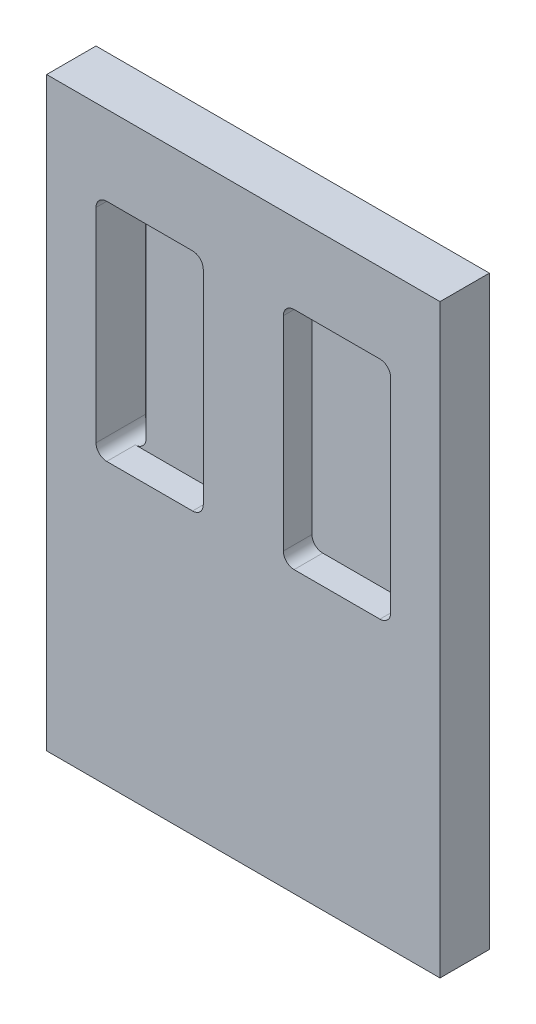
ISO-10303-21;
HEADER;
FILE_DESCRIPTION(('STEP AP214'),'2;1');
FILE_NAME('part.step','',(''),(''),'','','');
FILE_SCHEMA(('AUTOMOTIVE_DESIGN { 1 0 10303 214 1 1 1 1 }'));
ENDSEC;
DATA;
#1=APPLICATION_CONTEXT('core data for automotive mechanical design processes');
#2=APPLICATION_PROTOCOL_DEFINITION('international standard','automotive_design',2000,#1);
#3=PRODUCT_CONTEXT('',#1,'mechanical');
#4=PRODUCT('Part','Part','',(#3));
#5=PRODUCT_RELATED_PRODUCT_CATEGORY('part','',(#4));
#6=PRODUCT_DEFINITION_FORMATION('','',#4);
#7=PRODUCT_DEFINITION_CONTEXT('part definition',#1,'design');
#8=PRODUCT_DEFINITION('design','',#6,#7);
#9=PRODUCT_DEFINITION_SHAPE('','',#8);
#10=(LENGTH_UNIT() NAMED_UNIT(*) SI_UNIT(.MILLI.,.METRE.));
#11=(NAMED_UNIT(*) PLANE_ANGLE_UNIT() SI_UNIT($,.RADIAN.));
#12=(NAMED_UNIT(*) SI_UNIT($,.STERADIAN.) SOLID_ANGLE_UNIT());
#13=UNCERTAINTY_MEASURE_WITH_UNIT(LENGTH_MEASURE(1.E-05),#10,'distance_accuracy_value','');
#14=(GEOMETRIC_REPRESENTATION_CONTEXT(3) GLOBAL_UNCERTAINTY_ASSIGNED_CONTEXT((#13)) GLOBAL_UNIT_ASSIGNED_CONTEXT((#10,
#11,#12)) REPRESENTATION_CONTEXT('',''));
#15=CARTESIAN_POINT('',(0.,0.,0.));
#16=DIRECTION('',(0.,0.,1.));
#17=DIRECTION('',(1.,0.,0.));
#18=AXIS2_PLACEMENT_3D('',#15,#16,#17);
#19=CARTESIAN_POINT('',(10.668,51.7525,8.763));
#20=DIRECTION('',(0.,0.,-1.));
#21=DIRECTION('',(-1.,0.,0.));
#22=AXIS2_PLACEMENT_3D('',#19,#20,#21);
#23=CYLINDRICAL_SURFACE('',#22,1.905);
#24=CARTESIAN_POINT('',(10.668,51.7525,0.));
#25=DIRECTION('',(0.,0.,1.));
#26=DIRECTION('',(1.,0.,0.));
#27=AXIS2_PLACEMENT_3D('',#24,#25,#26);
#28=CIRCLE('',#27,1.905);
#29=CARTESIAN_POINT('',(8.763,51.7525,0.));
#30=VERTEX_POINT('',#29);
#31=CARTESIAN_POINT('',(12.573,51.7525,0.));
#32=VERTEX_POINT('',#31);
#33=EDGE_CURVE('E335',#30,#32,#28,.T.);
#34=ORIENTED_EDGE('',*,*,#33,.F.);
#35=DIRECTION('',(0.,0.,-1.));
#36=VECTOR('',#35,1.);
#37=CARTESIAN_POINT('',(8.763,51.7525,8.763));
#38=LINE('',#37,#36);
#39=CARTESIAN_POINT('',(8.763,51.7525,8.763));
#40=VERTEX_POINT('',#39);
#41=EDGE_CURVE('E343',#40,#30,#38,.T.);
#42=ORIENTED_EDGE('',*,*,#41,.F.);
#43=CARTESIAN_POINT('',(10.668,51.7525,8.763));
#44=DIRECTION('',(0.,0.,1.));
#45=DIRECTION('',(1.,0.,0.));
#46=AXIS2_PLACEMENT_3D('',#43,#44,#45);
#47=CIRCLE('',#46,1.905);
#48=CARTESIAN_POINT('',(10.668,49.8475,8.763));
#49=VERTEX_POINT('',#48);
#50=EDGE_CURVE('E326',#40,#49,#47,.T.);
#51=ORIENTED_EDGE('',*,*,#50,.T.);
#52=DIRECTION('',(0.,0.,1.));
#53=VECTOR('',#52,1.);
#54=CARTESIAN_POINT('',(10.668,49.8475,3.683));
#55=LINE('',#54,#53);
#56=CARTESIAN_POINT('',(10.668,49.8475,3.683));
#57=VERTEX_POINT('',#56);
#58=EDGE_CURVE('E237',#57,#49,#55,.T.);
#59=ORIENTED_EDGE('',*,*,#58,.F.);
#60=CARTESIAN_POINT('',(10.668,51.7525,3.683));
#61=DIRECTION('',(0.,0.,1.));
#62=DIRECTION('',(1.,0.,0.));
#63=AXIS2_PLACEMENT_3D('',#60,#61,#62);
#64=CIRCLE('',#63,1.905);
#65=CARTESIAN_POINT('',(12.573,51.7525,3.683));
#66=VERTEX_POINT('',#65);
#67=EDGE_CURVE('E236',#57,#66,#64,.T.);
#68=ORIENTED_EDGE('',*,*,#67,.T.);
#69=DIRECTION('',(0.,0.,-1.));
#70=VECTOR('',#69,1.);
#71=CARTESIAN_POINT('',(12.573,51.7525,8.763));
#72=LINE('',#71,#70);
#73=EDGE_CURVE('E341',#66,#32,#72,.T.);
#74=ORIENTED_EDGE('',*,*,#73,.T.);
#75=EDGE_LOOP('',(#34,#42,#51,#59,#68,#74));
#76=FACE_BOUND('',#75,.T.);
#77=ADVANCED_FACE('F32',(#76),#23,.F.);
#78=CARTESIAN_POINT('',(12.573,87.9475,8.763));
#79=DIRECTION('',(-1.,0.,0.));
#80=DIRECTION('',(0.,-1.,0.));
#81=AXIS2_PLACEMENT_3D('',#78,#79,#80);
#82=PLANE('',#81);
#83=ORIENTED_EDGE('',*,*,#73,.F.);
#84=DIRECTION('',(0.,1.,0.));
#85=VECTOR('',#84,1.);
#86=CARTESIAN_POINT('',(12.573,87.9475,3.683));
#87=LINE('',#86,#85);
#88=CARTESIAN_POINT('',(12.573,87.9475,3.683));
#89=VERTEX_POINT('',#88);
#90=EDGE_CURVE('E11',#66,#89,#87,.T.);
#91=ORIENTED_EDGE('',*,*,#90,.T.);
#92=DIRECTION('',(0.,0.,-1.));
#93=VECTOR('',#92,1.);
#94=CARTESIAN_POINT('',(12.573,87.9475,8.763));
#95=LINE('',#94,#93);
#96=CARTESIAN_POINT('',(12.573,87.9475,0.));
#97=VERTEX_POINT('',#96);
#98=EDGE_CURVE('E329',#89,#97,#95,.T.);
#99=ORIENTED_EDGE('',*,*,#98,.T.);
#100=DIRECTION('',(0.,1.,0.));
#101=VECTOR('',#100,1.);
#102=CARTESIAN_POINT('',(12.573,87.9475,0.));
#103=LINE('',#102,#101);
#104=EDGE_CURVE('E324',#32,#97,#103,.T.);
#105=ORIENTED_EDGE('',*,*,#104,.F.);
#106=EDGE_LOOP('',(#83,#91,#99,#105));
#107=FACE_BOUND('',#106,.T.);
#108=ADVANCED_FACE('F398',(#107),#82,.T.);
#109=CARTESIAN_POINT('',(0.,104.013,8.763));
#110=DIRECTION('',(0.,0.,-1.));
#111=DIRECTION('',(-1.,0.,0.));
#112=AXIS2_PLACEMENT_3D('',#109,#110,#111);
#113=PLANE('',#112);
#114=CARTESIAN_POINT('',(25.908,51.7525,8.763));
#115=DIRECTION('',(0.,0.,1.));
#116=DIRECTION('',(1.,0.,0.));
#117=AXIS2_PLACEMENT_3D('',#114,#115,#116);
#118=CIRCLE('',#117,1.905);
#119=CARTESIAN_POINT('',(25.908,49.8475,8.763));
#120=VERTEX_POINT('',#119);
#121=CARTESIAN_POINT('',(27.813,51.7525,8.763));
#122=VERTEX_POINT('',#121);
#123=EDGE_CURVE('E201',#120,#122,#118,.T.);
#124=ORIENTED_EDGE('',*,*,#123,.F.);
#125=DIRECTION('',(1.,0.,0.));
#126=VECTOR('',#125,1.);
#127=CARTESIAN_POINT('',(10.668,49.8475,8.763));
#128=LINE('',#127,#126);
#129=EDGE_CURVE('E217',#49,#120,#128,.T.);
#130=ORIENTED_EDGE('',*,*,#129,.F.);
#131=ORIENTED_EDGE('',*,*,#50,.F.);
#132=DIRECTION('',(0.,-1.,0.));
#133=VECTOR('',#132,1.);
#134=CARTESIAN_POINT('',(8.76299999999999,87.9475,8.763));
#135=LINE('',#134,#133);
#136=CARTESIAN_POINT('',(8.76299999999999,87.9475,8.763));
#137=VERTEX_POINT('',#136);
#138=EDGE_CURVE('E323',#137,#40,#135,.T.);
#139=ORIENTED_EDGE('',*,*,#138,.F.);
#140=CARTESIAN_POINT('',(10.668,87.9475,8.763));
#141=DIRECTION('',(0.,0.,1.));
#142=DIRECTION('',(1.,0.,0.));
#143=AXIS2_PLACEMENT_3D('',#140,#141,#142);
#144=CIRCLE('',#143,1.905);
#145=CARTESIAN_POINT('',(10.668,89.8525,8.763));
#146=VERTEX_POINT('',#145);
#147=EDGE_CURVE('E321',#146,#137,#144,.T.);
#148=ORIENTED_EDGE('',*,*,#147,.F.);
#149=DIRECTION('',(-1.,0.,0.));
#150=VECTOR('',#149,1.);
#151=CARTESIAN_POINT('',(10.668,89.8525,8.763));
#152=LINE('',#151,#150);
#153=CARTESIAN_POINT('',(25.908,89.8525,8.763));
#154=VERTEX_POINT('',#153);
#155=EDGE_CURVE('E220',#154,#146,#152,.T.);
#156=ORIENTED_EDGE('',*,*,#155,.F.);
#157=CARTESIAN_POINT('',(25.908,87.9475,8.763));
#158=DIRECTION('',(0.,0.,1.));
#159=DIRECTION('',(1.,0.,0.));
#160=AXIS2_PLACEMENT_3D('',#157,#158,#159);
#161=CIRCLE('',#160,1.905);
#162=CARTESIAN_POINT('',(27.813,87.9475,8.763));
#163=VERTEX_POINT('',#162);
#164=EDGE_CURVE('E230',#163,#154,#161,.T.);
#165=ORIENTED_EDGE('',*,*,#164,.F.);
#166=DIRECTION('',(0.,1.,0.));
#167=VECTOR('',#166,1.);
#168=CARTESIAN_POINT('',(27.813,87.9475,8.763));
#169=LINE('',#168,#167);
#170=EDGE_CURVE('E228',#122,#163,#169,.T.);
#171=ORIENTED_EDGE('',*,*,#170,.F.);
#172=EDGE_LOOP('',(#124,#130,#131,#139,#148,#156,#165,#171));
#173=FACE_BOUND('',#172,.T.);
#174=DIRECTION('',(0.,-1.,0.));
#175=VECTOR('',#174,1.);
#176=CARTESIAN_POINT('',(0.,0.,8.763));
#177=LINE('',#176,#175);
#178=CARTESIAN_POINT('',(0.,104.013,8.763));
#179=VERTEX_POINT('',#178);
#180=CARTESIAN_POINT('',(0.,0.,8.763));
#181=VERTEX_POINT('',#180);
#182=EDGE_CURVE('E348',#179,#181,#177,.T.);
#183=ORIENTED_EDGE('',*,*,#182,.T.);
#184=DIRECTION('',(1.,0.,0.));
#185=VECTOR('',#184,1.);
#186=CARTESIAN_POINT('',(0.,0.,8.763));
#187=LINE('',#186,#185);
#188=CARTESIAN_POINT('',(69.85,0.,8.763));
#189=VERTEX_POINT('',#188);
#190=EDGE_CURVE('E351',#181,#189,#187,.T.);
#191=ORIENTED_EDGE('',*,*,#190,.T.);
#192=DIRECTION('',(0.,1.,0.));
#193=VECTOR('',#192,1.);
#194=CARTESIAN_POINT('',(69.85,0.,8.763));
#195=LINE('',#194,#193);
#196=CARTESIAN_POINT('',(69.85,104.013,8.763));
#197=VERTEX_POINT('',#196);
#198=EDGE_CURVE('E354',#189,#197,#195,.T.);
#199=ORIENTED_EDGE('',*,*,#198,.T.);
#200=DIRECTION('',(-1.,0.,0.));
#201=VECTOR('',#200,1.);
#202=CARTESIAN_POINT('',(0.,104.013,8.763));
#203=LINE('',#202,#201);
#204=EDGE_CURVE('E356',#197,#179,#203,.T.);
#205=ORIENTED_EDGE('',*,*,#204,.T.);
#206=EDGE_LOOP('',(#183,#191,#199,#205));
#207=FACE_BOUND('',#206,.T.);
#208=CARTESIAN_POINT('',(59.182,51.7525,8.763));
#209=DIRECTION('',(0.,0.,1.));
#210=DIRECTION('',(1.,0.,0.));
#211=AXIS2_PLACEMENT_3D('',#208,#209,#210);
#212=CIRCLE('',#211,1.90500000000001);
#213=CARTESIAN_POINT('',(59.182,49.8475,8.763));
#214=VERTEX_POINT('',#213);
#215=CARTESIAN_POINT('',(61.087,51.7525,8.763));
#216=VERTEX_POINT('',#215);
#217=EDGE_CURVE('E297',#214,#216,#212,.T.);
#218=ORIENTED_EDGE('',*,*,#217,.F.);
#219=DIRECTION('',(1.,0.,0.));
#220=VECTOR('',#219,1.);
#221=CARTESIAN_POINT('',(59.182,49.8475,8.763));
#222=LINE('',#221,#220);
#223=CARTESIAN_POINT('',(43.942,49.8475,8.763));
#224=VERTEX_POINT('',#223);
#225=EDGE_CURVE('E253',#224,#214,#222,.T.);
#226=ORIENTED_EDGE('',*,*,#225,.F.);
#227=CARTESIAN_POINT('',(43.942,51.7525,8.763));
#228=DIRECTION('',(0.,0.,1.));
#229=DIRECTION('',(-1.,0.,0.));
#230=AXIS2_PLACEMENT_3D('',#227,#228,#229);
#231=CIRCLE('',#230,1.905);
#232=CARTESIAN_POINT('',(42.037,51.7525,8.763));
#233=VERTEX_POINT('',#232);
#234=EDGE_CURVE('E271',#233,#224,#231,.T.);
#235=ORIENTED_EDGE('',*,*,#234,.F.);
#236=DIRECTION('',(0.,-1.,0.));
#237=VECTOR('',#236,1.);
#238=CARTESIAN_POINT('',(42.037,87.9475,8.763));
#239=LINE('',#238,#237);
#240=CARTESIAN_POINT('',(42.037,87.9475,8.763));
#241=VERTEX_POINT('',#240);
#242=EDGE_CURVE('E268',#241,#233,#239,.T.);
#243=ORIENTED_EDGE('',*,*,#242,.F.);
#244=CARTESIAN_POINT('',(43.942,87.9475,8.763));
#245=DIRECTION('',(0.,0.,1.));
#246=DIRECTION('',(-1.,0.,0.));
#247=AXIS2_PLACEMENT_3D('',#244,#245,#246);
#248=CIRCLE('',#247,1.905);
#249=CARTESIAN_POINT('',(43.942,89.8525,8.763));
#250=VERTEX_POINT('',#249);
#251=EDGE_CURVE('E265',#250,#241,#248,.T.);
#252=ORIENTED_EDGE('',*,*,#251,.F.);
#253=DIRECTION('',(-1.,0.,0.));
#254=VECTOR('',#253,1.);
#255=CARTESIAN_POINT('',(59.182,89.8525,8.763));
#256=LINE('',#255,#254);
#257=CARTESIAN_POINT('',(59.182,89.8525,8.763));
#258=VERTEX_POINT('',#257);
#259=EDGE_CURVE('E248',#258,#250,#256,.T.);
#260=ORIENTED_EDGE('',*,*,#259,.F.);
#261=CARTESIAN_POINT('',(59.182,87.9475,8.763));
#262=DIRECTION('',(0.,0.,1.));
#263=DIRECTION('',(1.,0.,0.));
#264=AXIS2_PLACEMENT_3D('',#261,#262,#263);
#265=CIRCLE('',#264,1.90500000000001);
#266=CARTESIAN_POINT('',(61.087,87.9475,8.763));
#267=VERTEX_POINT('',#266);
#268=EDGE_CURVE('E294',#267,#258,#265,.T.);
#269=ORIENTED_EDGE('',*,*,#268,.F.);
#270=DIRECTION('',(0.,1.,0.));
#271=VECTOR('',#270,1.);
#272=CARTESIAN_POINT('',(61.087,87.9475,8.763));
#273=LINE('',#272,#271);
#274=EDGE_CURVE('E300',#216,#267,#273,.T.);
#275=ORIENTED_EDGE('',*,*,#274,.F.);
#276=EDGE_LOOP('',(#218,#226,#235,#243,#252,#260,#269,#275));
#277=FACE_BOUND('',#276,.T.);
#278=ADVANCED_FACE('F395',(#173,#207,#277),#113,.F.);
#279=CARTESIAN_POINT('',(0.,104.013,0.));
#280=DIRECTION('',(0.,0.,-1.));
#281=DIRECTION('',(-1.,0.,0.));
#282=AXIS2_PLACEMENT_3D('',#279,#280,#281);
#283=PLANE('',#282);
#284=ORIENTED_EDGE('',*,*,#104,.T.);
#285=CARTESIAN_POINT('',(10.668,87.9475,0.));
#286=DIRECTION('',(0.,0.,1.));
#287=DIRECTION('',(1.,0.,0.));
#288=AXIS2_PLACEMENT_3D('',#285,#286,#287);
#289=CIRCLE('',#288,1.905);
#290=CARTESIAN_POINT('',(8.76299999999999,87.9475,0.));
#291=VERTEX_POINT('',#290);
#292=EDGE_CURVE('E320',#97,#291,#289,.T.);
#293=ORIENTED_EDGE('',*,*,#292,.T.);
#294=DIRECTION('',(0.,-1.,0.));
#295=VECTOR('',#294,1.);
#296=CARTESIAN_POINT('',(8.76299999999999,87.9475,0.));
#297=LINE('',#296,#295);
#298=EDGE_CURVE('E332',#291,#30,#297,.T.);
#299=ORIENTED_EDGE('',*,*,#298,.T.);
#300=ORIENTED_EDGE('',*,*,#33,.T.);
#301=EDGE_LOOP('',(#284,#293,#299,#300));
#302=FACE_BOUND('',#301,.T.);
#303=DIRECTION('',(0.,-1.,0.));
#304=VECTOR('',#303,1.);
#305=CARTESIAN_POINT('',(0.,0.,0.));
#306=LINE('',#305,#304);
#307=CARTESIAN_POINT('',(0.,104.013,0.));
#308=VERTEX_POINT('',#307);
#309=CARTESIAN_POINT('',(0.,0.,0.));
#310=VERTEX_POINT('',#309);
#311=EDGE_CURVE('E347',#308,#310,#306,.T.);
#312=ORIENTED_EDGE('',*,*,#311,.F.);
#313=DIRECTION('',(-1.,0.,0.));
#314=VECTOR('',#313,1.);
#315=CARTESIAN_POINT('',(0.,104.013,0.));
#316=LINE('',#315,#314);
#317=CARTESIAN_POINT('',(69.85,104.013,0.));
#318=VERTEX_POINT('',#317);
#319=EDGE_CURVE('E352',#318,#308,#316,.T.);
#320=ORIENTED_EDGE('',*,*,#319,.F.);
#321=DIRECTION('',(0.,1.,0.));
#322=VECTOR('',#321,1.);
#323=CARTESIAN_POINT('',(69.85,0.,0.));
#324=LINE('',#323,#322);
#325=CARTESIAN_POINT('',(69.85,0.,0.));
#326=VERTEX_POINT('',#325);
#327=EDGE_CURVE('E363',#326,#318,#324,.T.);
#328=ORIENTED_EDGE('',*,*,#327,.F.);
#329=DIRECTION('',(1.,0.,0.));
#330=VECTOR('',#329,1.);
#331=CARTESIAN_POINT('',(0.,0.,0.));
#332=LINE('',#331,#330);
#333=EDGE_CURVE('E361',#310,#326,#332,.T.);
#334=ORIENTED_EDGE('',*,*,#333,.F.);
#335=EDGE_LOOP('',(#312,#320,#328,#334));
#336=FACE_BOUND('',#335,.T.);
#337=DIRECTION('',(0.,1.,0.));
#338=VECTOR('',#337,1.);
#339=CARTESIAN_POINT('',(61.087,87.9475,0.));
#340=LINE('',#339,#338);
#341=CARTESIAN_POINT('',(61.087,51.7525,0.));
#342=VERTEX_POINT('',#341);
#343=CARTESIAN_POINT('',(61.087,87.9475,0.));
#344=VERTEX_POINT('',#343);
#345=EDGE_CURVE('E298',#342,#344,#340,.T.);
#346=ORIENTED_EDGE('',*,*,#345,.T.);
#347=CARTESIAN_POINT('',(59.182,87.9475,0.));
#348=DIRECTION('',(0.,0.,1.));
#349=DIRECTION('',(1.,0.,0.));
#350=AXIS2_PLACEMENT_3D('',#347,#348,#349);
#351=CIRCLE('',#350,1.90500000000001);
#352=CARTESIAN_POINT('',(57.277,87.9475,0.));
#353=VERTEX_POINT('',#352);
#354=EDGE_CURVE('E293',#344,#353,#351,.T.);
#355=ORIENTED_EDGE('',*,*,#354,.T.);
#356=DIRECTION('',(0.,-1.,0.));
#357=VECTOR('',#356,1.);
#358=CARTESIAN_POINT('',(57.277,87.9475,0.));
#359=LINE('',#358,#357);
#360=CARTESIAN_POINT('',(57.277,51.7525,0.));
#361=VERTEX_POINT('',#360);
#362=EDGE_CURVE('E305',#353,#361,#359,.T.);
#363=ORIENTED_EDGE('',*,*,#362,.T.);
#364=CARTESIAN_POINT('',(59.182,51.7525,0.));
#365=DIRECTION('',(0.,0.,1.));
#366=DIRECTION('',(1.,0.,0.));
#367=AXIS2_PLACEMENT_3D('',#364,#365,#366);
#368=CIRCLE('',#367,1.90500000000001);
#369=EDGE_CURVE('E308',#361,#342,#368,.T.);
#370=ORIENTED_EDGE('',*,*,#369,.T.);
#371=EDGE_LOOP('',(#346,#355,#363,#370));
#372=FACE_BOUND('',#371,.T.);
#373=ADVANCED_FACE('F384',(#302,#336,#372),#283,.T.);
#374=CARTESIAN_POINT('',(0.,0.,8.763));
#375=DIRECTION('',(1.,0.,0.));
#376=DIRECTION('',(0.,0.,-1.));
#377=AXIS2_PLACEMENT_3D('',#374,#375,#376);
#378=PLANE('',#377);
#379=ORIENTED_EDGE('',*,*,#311,.T.);
#380=DIRECTION('',(0.,0.,-1.));
#381=VECTOR('',#380,1.);
#382=CARTESIAN_POINT('',(0.,0.,8.763));
#383=LINE('',#382,#381);
#384=EDGE_CURVE('E40',#181,#310,#383,.T.);
#385=ORIENTED_EDGE('',*,*,#384,.F.);
#386=ORIENTED_EDGE('',*,*,#182,.F.);
#387=DIRECTION('',(0.,0.,-1.));
#388=VECTOR('',#387,1.);
#389=CARTESIAN_POINT('',(0.,104.013,8.763));
#390=LINE('',#389,#388);
#391=EDGE_CURVE('E358',#179,#308,#390,.T.);
#392=ORIENTED_EDGE('',*,*,#391,.T.);
#393=EDGE_LOOP('',(#379,#385,#386,#392));
#394=FACE_BOUND('',#393,.T.);
#395=ADVANCED_FACE('F34',(#394),#378,.F.);
#396=CARTESIAN_POINT('',(0.,0.,8.763));
#397=DIRECTION('',(0.,1.,0.));
#398=DIRECTION('',(0.,0.,1.));
#399=AXIS2_PLACEMENT_3D('',#396,#397,#398);
#400=PLANE('',#399);
#401=ORIENTED_EDGE('',*,*,#333,.T.);
#402=DIRECTION('',(0.,0.,-1.));
#403=VECTOR('',#402,1.);
#404=CARTESIAN_POINT('',(69.85,0.,8.763));
#405=LINE('',#404,#403);
#406=EDGE_CURVE('E371',#189,#326,#405,.T.);
#407=ORIENTED_EDGE('',*,*,#406,.F.);
#408=ORIENTED_EDGE('',*,*,#190,.F.);
#409=ORIENTED_EDGE('',*,*,#384,.T.);
#410=EDGE_LOOP('',(#401,#407,#408,#409));
#411=FACE_BOUND('',#410,.T.);
#412=ADVANCED_FACE('F376',(#411),#400,.F.);
#413=CARTESIAN_POINT('',(69.85,0.,8.763));
#414=DIRECTION('',(-1.,0.,0.));
#415=DIRECTION('',(0.,0.,1.));
#416=AXIS2_PLACEMENT_3D('',#413,#414,#415);
#417=PLANE('',#416);
#418=ORIENTED_EDGE('',*,*,#327,.T.);
#419=DIRECTION('',(0.,0.,-1.));
#420=VECTOR('',#419,1.);
#421=CARTESIAN_POINT('',(69.85,104.013,8.763));
#422=LINE('',#421,#420);
#423=EDGE_CURVE('E368',#197,#318,#422,.T.);
#424=ORIENTED_EDGE('',*,*,#423,.F.);
#425=ORIENTED_EDGE('',*,*,#198,.F.);
#426=ORIENTED_EDGE('',*,*,#406,.T.);
#427=EDGE_LOOP('',(#418,#424,#425,#426));
#428=FACE_BOUND('',#427,.T.);
#429=ADVANCED_FACE('F389',(#428),#417,.F.);
#430=CARTESIAN_POINT('',(0.,104.013,8.763));
#431=DIRECTION('',(0.,-1.,0.));
#432=DIRECTION('',(0.,0.,-1.));
#433=AXIS2_PLACEMENT_3D('',#430,#431,#432);
#434=PLANE('',#433);
#435=ORIENTED_EDGE('',*,*,#319,.T.);
#436=ORIENTED_EDGE('',*,*,#391,.F.);
#437=ORIENTED_EDGE('',*,*,#204,.F.);
#438=ORIENTED_EDGE('',*,*,#423,.T.);
#439=EDGE_LOOP('',(#435,#436,#437,#438));
#440=FACE_BOUND('',#439,.T.);
#441=ADVANCED_FACE('F393',(#440),#434,.F.);
#442=CARTESIAN_POINT('',(10.668,87.9475,8.763));
#443=DIRECTION('',(0.,0.,-1.));
#444=DIRECTION('',(-1.,0.,0.));
#445=AXIS2_PLACEMENT_3D('',#442,#443,#444);
#446=CYLINDRICAL_SURFACE('',#445,1.905);
#447=DIRECTION('',(0.,0.,1.));
#448=VECTOR('',#447,1.);
#449=CARTESIAN_POINT('',(10.668,89.8525,3.683));
#450=LINE('',#449,#448);
#451=CARTESIAN_POINT('',(10.668,89.8525,3.683));
#452=VERTEX_POINT('',#451);
#453=EDGE_CURVE('E239',#452,#146,#450,.T.);
#454=ORIENTED_EDGE('',*,*,#453,.T.);
#455=ORIENTED_EDGE('',*,*,#147,.T.);
#456=DIRECTION('',(0.,0.,-1.));
#457=VECTOR('',#456,1.);
#458=CARTESIAN_POINT('',(8.76299999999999,87.9475,8.763));
#459=LINE('',#458,#457);
#460=EDGE_CURVE('E345',#137,#291,#459,.T.);
#461=ORIENTED_EDGE('',*,*,#460,.T.);
#462=ORIENTED_EDGE('',*,*,#292,.F.);
#463=ORIENTED_EDGE('',*,*,#98,.F.);
#464=CARTESIAN_POINT('',(10.668,87.9475,3.683));
#465=DIRECTION('',(0.,0.,1.));
#466=DIRECTION('',(1.,0.,0.));
#467=AXIS2_PLACEMENT_3D('',#464,#465,#466);
#468=CIRCLE('',#467,1.905);
#469=EDGE_CURVE('E47',#89,#452,#468,.T.);
#470=ORIENTED_EDGE('',*,*,#469,.T.);
#471=EDGE_LOOP('',(#454,#455,#461,#462,#463,#470));
#472=FACE_BOUND('',#471,.T.);
#473=ADVANCED_FACE('F467',(#472),#446,.F.);
#474=CARTESIAN_POINT('',(8.76299999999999,87.9475,8.763));
#475=DIRECTION('',(1.,0.,0.));
#476=DIRECTION('',(0.,1.,0.));
#477=AXIS2_PLACEMENT_3D('',#474,#475,#476);
#478=PLANE('',#477);
#479=ORIENTED_EDGE('',*,*,#41,.T.);
#480=ORIENTED_EDGE('',*,*,#298,.F.);
#481=ORIENTED_EDGE('',*,*,#460,.F.);
#482=ORIENTED_EDGE('',*,*,#138,.T.);
#483=EDGE_LOOP('',(#479,#480,#481,#482));
#484=FACE_BOUND('',#483,.T.);
#485=ADVANCED_FACE('F464',(#484),#478,.T.);
#486=CARTESIAN_POINT('',(59.182,87.9475,8.763));
#487=DIRECTION('',(0.,0.,-1.));
#488=DIRECTION('',(-1.,0.,0.));
#489=AXIS2_PLACEMENT_3D('',#486,#487,#488);
#490=CYLINDRICAL_SURFACE('',#489,1.90500000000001);
#491=ORIENTED_EDGE('',*,*,#354,.F.);
#492=DIRECTION('',(0.,0.,-1.));
#493=VECTOR('',#492,1.);
#494=CARTESIAN_POINT('',(61.087,87.9475,8.763));
#495=LINE('',#494,#493);
#496=EDGE_CURVE('E302',#267,#344,#495,.T.);
#497=ORIENTED_EDGE('',*,*,#496,.F.);
#498=ORIENTED_EDGE('',*,*,#268,.T.);
#499=DIRECTION('',(0.,0.,1.));
#500=VECTOR('',#499,1.);
#501=CARTESIAN_POINT('',(59.182,89.8525,3.683));
#502=LINE('',#501,#500);
#503=CARTESIAN_POINT('',(59.182,89.8525,3.683));
#504=VERTEX_POINT('',#503);
#505=EDGE_CURVE('E262',#504,#258,#502,.T.);
#506=ORIENTED_EDGE('',*,*,#505,.F.);
#507=CARTESIAN_POINT('',(59.182,87.9475,3.683));
#508=DIRECTION('',(0.,0.,-1.));
#509=DIRECTION('',(-1.,0.,0.));
#510=AXIS2_PLACEMENT_3D('',#507,#508,#509);
#511=CIRCLE('',#510,1.90500000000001);
#512=CARTESIAN_POINT('',(57.277,87.9475,3.683));
#513=VERTEX_POINT('',#512);
#514=EDGE_CURVE('E291',#513,#504,#511,.T.);
#515=ORIENTED_EDGE('',*,*,#514,.F.);
#516=DIRECTION('',(0.,0.,-1.));
#517=VECTOR('',#516,1.);
#518=CARTESIAN_POINT('',(57.277,87.9475,8.763));
#519=LINE('',#518,#517);
#520=EDGE_CURVE('E318',#513,#353,#519,.T.);
#521=ORIENTED_EDGE('',*,*,#520,.T.);
#522=EDGE_LOOP('',(#491,#497,#498,#506,#515,#521));
#523=FACE_BOUND('',#522,.T.);
#524=ADVANCED_FACE('F427',(#523),#490,.F.);
#525=CARTESIAN_POINT('',(57.277,87.9475,8.763));
#526=DIRECTION('',(1.,0.,0.));
#527=DIRECTION('',(0.,1.,0.));
#528=AXIS2_PLACEMENT_3D('',#525,#526,#527);
#529=PLANE('',#528);
#530=DIRECTION('',(0.,1.,0.));
#531=VECTOR('',#530,1.);
#532=CARTESIAN_POINT('',(57.277,87.9475,3.683));
#533=LINE('',#532,#531);
#534=CARTESIAN_POINT('',(57.277,51.7525,3.683));
#535=VERTEX_POINT('',#534);
#536=EDGE_CURVE('E289',#535,#513,#533,.T.);
#537=ORIENTED_EDGE('',*,*,#536,.F.);
#538=DIRECTION('',(0.,0.,-1.));
#539=VECTOR('',#538,1.);
#540=CARTESIAN_POINT('',(57.277,51.7525,8.763));
#541=LINE('',#540,#539);
#542=EDGE_CURVE('E316',#535,#361,#541,.T.);
#543=ORIENTED_EDGE('',*,*,#542,.T.);
#544=ORIENTED_EDGE('',*,*,#362,.F.);
#545=ORIENTED_EDGE('',*,*,#520,.F.);
#546=EDGE_LOOP('',(#537,#543,#544,#545));
#547=FACE_BOUND('',#546,.T.);
#548=ADVANCED_FACE('F420',(#547),#529,.T.);
#549=CARTESIAN_POINT('',(59.182,51.7525,8.763));
#550=DIRECTION('',(0.,0.,-1.));
#551=DIRECTION('',(-1.,0.,0.));
#552=AXIS2_PLACEMENT_3D('',#549,#550,#551);
#553=CYLINDRICAL_SURFACE('',#552,1.90500000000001);
#554=CARTESIAN_POINT('',(59.182,51.7525,3.683));
#555=DIRECTION('',(0.,0.,-1.));
#556=DIRECTION('',(-1.,0.,0.));
#557=AXIS2_PLACEMENT_3D('',#554,#555,#556);
#558=CIRCLE('',#557,1.90500000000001);
#559=CARTESIAN_POINT('',(59.182,49.8475,3.683));
#560=VERTEX_POINT('',#559);
#561=EDGE_CURVE('E278',#560,#535,#558,.T.);
#562=ORIENTED_EDGE('',*,*,#561,.F.);
#563=DIRECTION('',(0.,0.,1.));
#564=VECTOR('',#563,1.);
#565=CARTESIAN_POINT('',(59.182,49.8475,3.683));
#566=LINE('',#565,#564);
#567=EDGE_CURVE('E275',#560,#214,#566,.T.);
#568=ORIENTED_EDGE('',*,*,#567,.T.);
#569=ORIENTED_EDGE('',*,*,#217,.T.);
#570=DIRECTION('',(0.,0.,-1.));
#571=VECTOR('',#570,1.);
#572=CARTESIAN_POINT('',(61.087,51.7525,8.763));
#573=LINE('',#572,#571);
#574=EDGE_CURVE('E314',#216,#342,#573,.T.);
#575=ORIENTED_EDGE('',*,*,#574,.T.);
#576=ORIENTED_EDGE('',*,*,#369,.F.);
#577=ORIENTED_EDGE('',*,*,#542,.F.);
#578=EDGE_LOOP('',(#562,#568,#569,#575,#576,#577));
#579=FACE_BOUND('',#578,.T.);
#580=ADVANCED_FACE('F409',(#579),#553,.F.);
#581=CARTESIAN_POINT('',(61.087,87.9475,8.763));
#582=DIRECTION('',(-1.,0.,0.));
#583=DIRECTION('',(0.,-1.,0.));
#584=AXIS2_PLACEMENT_3D('',#581,#582,#583);
#585=PLANE('',#584);
#586=ORIENTED_EDGE('',*,*,#345,.F.);
#587=ORIENTED_EDGE('',*,*,#574,.F.);
#588=ORIENTED_EDGE('',*,*,#274,.T.);
#589=ORIENTED_EDGE('',*,*,#496,.T.);
#590=EDGE_LOOP('',(#586,#587,#588,#589));
#591=FACE_BOUND('',#590,.T.);
#592=ADVANCED_FACE('F413',(#591),#585,.T.);
#593=CARTESIAN_POINT('',(59.182,49.8475,3.683));
#594=DIRECTION('',(0.,-1.,0.));
#595=DIRECTION('',(0.,0.,-1.));
#596=AXIS2_PLACEMENT_3D('',#593,#594,#595);
#597=PLANE('',#596);
#598=ORIENTED_EDGE('',*,*,#225,.T.);
#599=ORIENTED_EDGE('',*,*,#567,.F.);
#600=DIRECTION('',(1.,0.,0.));
#601=VECTOR('',#600,1.);
#602=CARTESIAN_POINT('',(59.182,49.8475,3.683));
#603=LINE('',#602,#601);
#604=CARTESIAN_POINT('',(43.942,49.8475,3.683));
#605=VERTEX_POINT('',#604);
#606=EDGE_CURVE('E54',#605,#560,#603,.T.);
#607=ORIENTED_EDGE('',*,*,#606,.F.);
#608=DIRECTION('',(0.,0.,1.));
#609=VECTOR('',#608,1.);
#610=CARTESIAN_POINT('',(43.942,49.8475,3.683));
#611=LINE('',#610,#609);
#612=EDGE_CURVE('E279',#605,#224,#611,.T.);
#613=ORIENTED_EDGE('',*,*,#612,.T.);
#614=EDGE_LOOP('',(#598,#599,#607,#613));
#615=FACE_BOUND('',#614,.T.);
#616=ADVANCED_FACE('F443',(#615),#597,.F.);
#617=CARTESIAN_POINT('',(43.942,51.7525,3.683));
#618=DIRECTION('',(0.,0.,1.));
#619=DIRECTION('',(1.,0.,0.));
#620=AXIS2_PLACEMENT_3D('',#617,#618,#619);
#621=CYLINDRICAL_SURFACE('',#620,1.905);
#622=ORIENTED_EDGE('',*,*,#234,.T.);
#623=ORIENTED_EDGE('',*,*,#612,.F.);
#624=CARTESIAN_POINT('',(43.942,51.7525,3.683));
#625=DIRECTION('',(0.,0.,1.));
#626=DIRECTION('',(-1.,0.,0.));
#627=AXIS2_PLACEMENT_3D('',#624,#625,#626);
#628=CIRCLE('',#627,1.905);
#629=CARTESIAN_POINT('',(42.037,51.7525,3.683));
#630=VERTEX_POINT('',#629);
#631=EDGE_CURVE('E259',#630,#605,#628,.T.);
#632=ORIENTED_EDGE('',*,*,#631,.F.);
#633=DIRECTION('',(0.,0.,1.));
#634=VECTOR('',#633,1.);
#635=CARTESIAN_POINT('',(42.037,51.7525,3.683));
#636=LINE('',#635,#634);
#637=EDGE_CURVE('E281',#630,#233,#636,.T.);
#638=ORIENTED_EDGE('',*,*,#637,.T.);
#639=EDGE_LOOP('',(#622,#623,#632,#638));
#640=FACE_BOUND('',#639,.T.);
#641=ADVANCED_FACE('F441',(#640),#621,.F.);
#642=CARTESIAN_POINT('',(42.037,87.9475,3.683));
#643=DIRECTION('',(-1.,0.,0.));
#644=DIRECTION('',(0.,-1.,0.));
#645=AXIS2_PLACEMENT_3D('',#642,#643,#644);
#646=PLANE('',#645);
#647=ORIENTED_EDGE('',*,*,#242,.T.);
#648=ORIENTED_EDGE('',*,*,#637,.F.);
#649=DIRECTION('',(0.,-1.,0.));
#650=VECTOR('',#649,1.);
#651=CARTESIAN_POINT('',(42.037,87.9475,3.683));
#652=LINE('',#651,#650);
#653=CARTESIAN_POINT('',(42.037,87.9475,3.683));
#654=VERTEX_POINT('',#653);
#655=EDGE_CURVE('E256',#654,#630,#652,.T.);
#656=ORIENTED_EDGE('',*,*,#655,.F.);
#657=DIRECTION('',(0.,0.,1.));
#658=VECTOR('',#657,1.);
#659=CARTESIAN_POINT('',(42.037,87.9475,3.683));
#660=LINE('',#659,#658);
#661=EDGE_CURVE('E283',#654,#241,#660,.T.);
#662=ORIENTED_EDGE('',*,*,#661,.T.);
#663=EDGE_LOOP('',(#647,#648,#656,#662));
#664=FACE_BOUND('',#663,.T.);
#665=ADVANCED_FACE('F439',(#664),#646,.F.);
#666=CARTESIAN_POINT('',(43.942,87.9475,3.683));
#667=DIRECTION('',(0.,0.,1.));
#668=DIRECTION('',(1.,0.,0.));
#669=AXIS2_PLACEMENT_3D('',#666,#667,#668);
#670=CYLINDRICAL_SURFACE('',#669,1.905);
#671=ORIENTED_EDGE('',*,*,#251,.T.);
#672=ORIENTED_EDGE('',*,*,#661,.F.);
#673=CARTESIAN_POINT('',(43.942,87.9475,3.683));
#674=DIRECTION('',(0.,0.,1.));
#675=DIRECTION('',(-1.,0.,0.));
#676=AXIS2_PLACEMENT_3D('',#673,#674,#675);
#677=CIRCLE('',#676,1.905);
#678=CARTESIAN_POINT('',(43.942,89.8525,3.683));
#679=VERTEX_POINT('',#678);
#680=EDGE_CURVE('E252',#679,#654,#677,.T.);
#681=ORIENTED_EDGE('',*,*,#680,.F.);
#682=DIRECTION('',(0.,0.,1.));
#683=VECTOR('',#682,1.);
#684=CARTESIAN_POINT('',(43.942,89.8525,3.683));
#685=LINE('',#684,#683);
#686=EDGE_CURVE('E285',#679,#250,#685,.T.);
#687=ORIENTED_EDGE('',*,*,#686,.T.);
#688=EDGE_LOOP('',(#671,#672,#681,#687));
#689=FACE_BOUND('',#688,.T.);
#690=ADVANCED_FACE('F434',(#689),#670,.F.);
#691=CARTESIAN_POINT('',(59.182,89.8525,3.683));
#692=DIRECTION('',(0.,1.,0.));
#693=DIRECTION('',(0.,0.,1.));
#694=AXIS2_PLACEMENT_3D('',#691,#692,#693);
#695=PLANE('',#694);
#696=ORIENTED_EDGE('',*,*,#259,.T.);
#697=ORIENTED_EDGE('',*,*,#686,.F.);
#698=DIRECTION('',(-1.,0.,0.));
#699=VECTOR('',#698,1.);
#700=CARTESIAN_POINT('',(59.182,89.8525,3.683));
#701=LINE('',#700,#699);
#702=EDGE_CURVE('E249',#504,#679,#701,.T.);
#703=ORIENTED_EDGE('',*,*,#702,.F.);
#704=ORIENTED_EDGE('',*,*,#505,.T.);
#705=EDGE_LOOP('',(#696,#697,#703,#704));
#706=FACE_BOUND('',#705,.T.);
#707=ADVANCED_FACE('F430',(#706),#695,.F.);
#708=CARTESIAN_POINT('',(59.182,87.9475,3.683));
#709=DIRECTION('',(0.,0.,-1.));
#710=DIRECTION('',(-1.,0.,0.));
#711=AXIS2_PLACEMENT_3D('',#708,#709,#710);
#712=PLANE('',#711);
#713=ORIENTED_EDGE('',*,*,#514,.T.);
#714=ORIENTED_EDGE('',*,*,#702,.T.);
#715=ORIENTED_EDGE('',*,*,#680,.T.);
#716=ORIENTED_EDGE('',*,*,#655,.T.);
#717=ORIENTED_EDGE('',*,*,#631,.T.);
#718=ORIENTED_EDGE('',*,*,#606,.T.);
#719=ORIENTED_EDGE('',*,*,#561,.T.);
#720=ORIENTED_EDGE('',*,*,#536,.T.);
#721=EDGE_LOOP('',(#713,#714,#715,#716,#717,#718,#719,#720));
#722=FACE_BOUND('',#721,.T.);
#723=ADVANCED_FACE('F423',(#722),#712,.F.);
#724=CARTESIAN_POINT('',(25.908,51.7525,3.683));
#725=DIRECTION('',(0.,0.,1.));
#726=DIRECTION('',(1.,0.,0.));
#727=AXIS2_PLACEMENT_3D('',#724,#725,#726);
#728=CYLINDRICAL_SURFACE('',#727,1.905);
#729=ORIENTED_EDGE('',*,*,#123,.T.);
#730=DIRECTION('',(0.,0.,1.));
#731=VECTOR('',#730,1.);
#732=CARTESIAN_POINT('',(27.813,51.7525,3.683));
#733=LINE('',#732,#731);
#734=CARTESIAN_POINT('',(27.813,51.7525,3.683));
#735=VERTEX_POINT('',#734);
#736=EDGE_CURVE('E194',#735,#122,#733,.T.);
#737=ORIENTED_EDGE('',*,*,#736,.F.);
#738=CARTESIAN_POINT('',(25.908,51.7525,3.683));
#739=DIRECTION('',(0.,0.,1.));
#740=DIRECTION('',(1.,0.,0.));
#741=AXIS2_PLACEMENT_3D('',#738,#739,#740);
#742=CIRCLE('',#741,1.905);
#743=CARTESIAN_POINT('',(25.908,49.8475,3.683));
#744=VERTEX_POINT('',#743);
#745=EDGE_CURVE('E198',#744,#735,#742,.T.);
#746=ORIENTED_EDGE('',*,*,#745,.F.);
#747=DIRECTION('',(0.,0.,1.));
#748=VECTOR('',#747,1.);
#749=CARTESIAN_POINT('',(25.908,49.8475,3.683));
#750=LINE('',#749,#748);
#751=EDGE_CURVE('E234',#744,#120,#750,.T.);
#752=ORIENTED_EDGE('',*,*,#751,.T.);
#753=EDGE_LOOP('',(#729,#737,#746,#752));
#754=FACE_BOUND('',#753,.T.);
#755=ADVANCED_FACE('F196',(#754),#728,.F.);
#756=CARTESIAN_POINT('',(10.668,49.8475,3.683));
#757=DIRECTION('',(0.,-1.,0.));
#758=DIRECTION('',(0.,0.,-1.));
#759=AXIS2_PLACEMENT_3D('',#756,#757,#758);
#760=PLANE('',#759);
#761=ORIENTED_EDGE('',*,*,#129,.T.);
#762=ORIENTED_EDGE('',*,*,#751,.F.);
#763=DIRECTION('',(1.,0.,0.));
#764=VECTOR('',#763,1.);
#765=CARTESIAN_POINT('',(10.668,49.8475,3.683));
#766=LINE('',#765,#764);
#767=EDGE_CURVE('E206',#57,#744,#766,.T.);
#768=ORIENTED_EDGE('',*,*,#767,.F.);
#769=ORIENTED_EDGE('',*,*,#58,.T.);
#770=EDGE_LOOP('',(#761,#762,#768,#769));
#771=FACE_BOUND('',#770,.T.);
#772=ADVANCED_FACE('F603',(#771),#760,.F.);
#773=CARTESIAN_POINT('',(10.668,89.8525,3.683));
#774=DIRECTION('',(0.,1.,0.));
#775=DIRECTION('',(0.,0.,1.));
#776=AXIS2_PLACEMENT_3D('',#773,#774,#775);
#777=PLANE('',#776);
#778=ORIENTED_EDGE('',*,*,#155,.T.);
#779=ORIENTED_EDGE('',*,*,#453,.F.);
#780=DIRECTION('',(-1.,0.,0.));
#781=VECTOR('',#780,1.);
#782=CARTESIAN_POINT('',(10.668,89.8525,3.683));
#783=LINE('',#782,#781);
#784=CARTESIAN_POINT('',(25.908,89.8525,3.683));
#785=VERTEX_POINT('',#784);
#786=EDGE_CURVE('E224',#785,#452,#783,.T.);
#787=ORIENTED_EDGE('',*,*,#786,.F.);
#788=DIRECTION('',(0.,0.,1.));
#789=VECTOR('',#788,1.);
#790=CARTESIAN_POINT('',(25.908,89.8525,3.683));
#791=LINE('',#790,#789);
#792=EDGE_CURVE('E242',#785,#154,#791,.T.);
#793=ORIENTED_EDGE('',*,*,#792,.T.);
#794=EDGE_LOOP('',(#778,#779,#787,#793));
#795=FACE_BOUND('',#794,.T.);
#796=ADVANCED_FACE('F612',(#795),#777,.F.);
#797=CARTESIAN_POINT('',(25.908,87.9475,3.683));
#798=DIRECTION('',(0.,0.,1.));
#799=DIRECTION('',(1.,0.,0.));
#800=AXIS2_PLACEMENT_3D('',#797,#798,#799);
#801=CYLINDRICAL_SURFACE('',#800,1.905);
#802=ORIENTED_EDGE('',*,*,#164,.T.);
#803=ORIENTED_EDGE('',*,*,#792,.F.);
#804=CARTESIAN_POINT('',(25.908,87.9475,3.683));
#805=DIRECTION('',(0.,0.,1.));
#806=DIRECTION('',(1.,0.,0.));
#807=AXIS2_PLACEMENT_3D('',#804,#805,#806);
#808=CIRCLE('',#807,1.905);
#809=CARTESIAN_POINT('',(27.813,87.9475,3.683));
#810=VERTEX_POINT('',#809);
#811=EDGE_CURVE('E213',#810,#785,#808,.T.);
#812=ORIENTED_EDGE('',*,*,#811,.F.);
#813=DIRECTION('',(0.,0.,1.));
#814=VECTOR('',#813,1.);
#815=CARTESIAN_POINT('',(27.813,87.9475,3.683));
#816=LINE('',#815,#814);
#817=EDGE_CURVE('E205',#810,#163,#816,.T.);
#818=ORIENTED_EDGE('',*,*,#817,.T.);
#819=EDGE_LOOP('',(#802,#803,#812,#818));
#820=FACE_BOUND('',#819,.T.);
#821=ADVANCED_FACE('F622',(#820),#801,.F.);
#822=CARTESIAN_POINT('',(27.813,87.9475,3.683));
#823=DIRECTION('',(1.,0.,0.));
#824=DIRECTION('',(0.,1.,0.));
#825=AXIS2_PLACEMENT_3D('',#822,#823,#824);
#826=PLANE('',#825);
#827=ORIENTED_EDGE('',*,*,#170,.T.);
#828=ORIENTED_EDGE('',*,*,#817,.F.);
#829=DIRECTION('',(0.,1.,0.));
#830=VECTOR('',#829,1.);
#831=CARTESIAN_POINT('',(27.813,87.9475,3.683));
#832=LINE('',#831,#830);
#833=EDGE_CURVE('E209',#735,#810,#832,.T.);
#834=ORIENTED_EDGE('',*,*,#833,.F.);
#835=ORIENTED_EDGE('',*,*,#736,.T.);
#836=EDGE_LOOP('',(#827,#828,#834,#835));
#837=FACE_BOUND('',#836,.T.);
#838=ADVANCED_FACE('F210',(#837),#826,.F.);
#839=CARTESIAN_POINT('',(25.908,51.7525,3.683));
#840=DIRECTION('',(0.,0.,1.));
#841=DIRECTION('',(1.,0.,0.));
#842=AXIS2_PLACEMENT_3D('',#839,#840,#841);
#843=PLANE('',#842);
#844=ORIENTED_EDGE('',*,*,#90,.F.);
#845=ORIENTED_EDGE('',*,*,#67,.F.);
#846=ORIENTED_EDGE('',*,*,#767,.T.);
#847=ORIENTED_EDGE('',*,*,#745,.T.);
#848=ORIENTED_EDGE('',*,*,#833,.T.);
#849=ORIENTED_EDGE('',*,*,#811,.T.);
#850=ORIENTED_EDGE('',*,*,#786,.T.);
#851=ORIENTED_EDGE('',*,*,#469,.F.);
#852=EDGE_LOOP('',(#844,#845,#846,#847,#848,#849,#850,#851));
#853=FACE_BOUND('',#852,.T.);
#854=ADVANCED_FACE('F215',(#853),#843,.T.);
#855=CLOSED_SHELL('',(#77,#108,#278,#373,#395,#412,#429,#441,#473,#485,#524,#548,#580,#592,#616,
#641,#665,#690,#707,#723,#755,#772,#796,#821,#838,#854));
#856=MANIFOLD_SOLID_BREP('B2',#855);
#857=ADVANCED_BREP_SHAPE_REPRESENTATION('',(#18,#856),#14);
#858=SHAPE_DEFINITION_REPRESENTATION(#9,#857);
ENDSEC;
END-ISO-10303-21;
